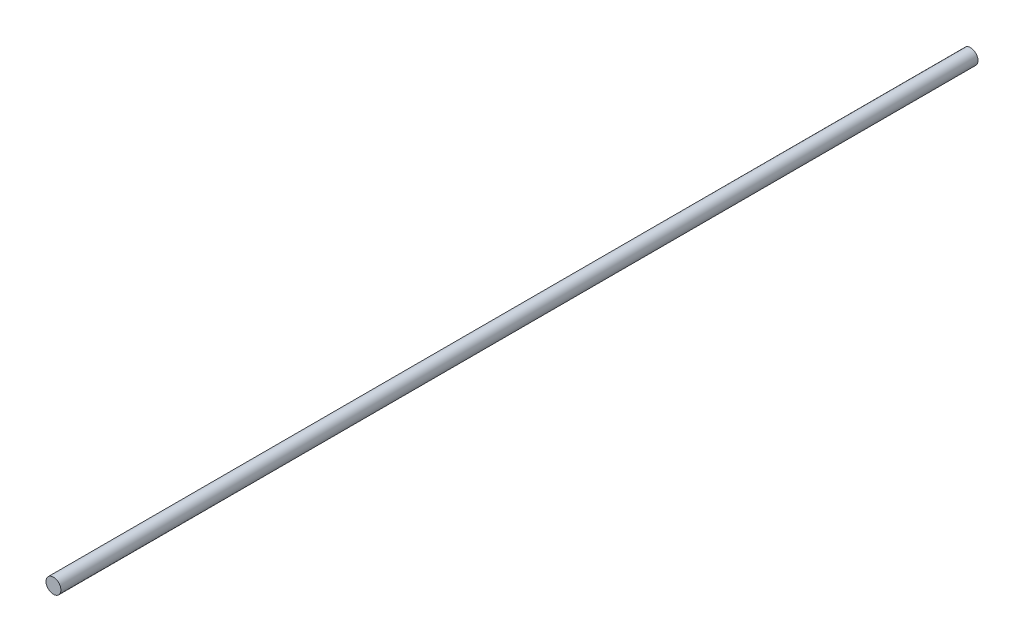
ISO-10303-21;
HEADER;
FILE_DESCRIPTION(('STEP AP214'),'2;1');
FILE_NAME('part.step','',(''),(''),'','','');
FILE_SCHEMA(('AUTOMOTIVE_DESIGN { 1 0 10303 214 1 1 1 1 }'));
ENDSEC;
DATA;
#1=APPLICATION_CONTEXT('core data for automotive mechanical design processes');
#2=APPLICATION_PROTOCOL_DEFINITION('international standard','automotive_design',2000,#1);
#3=PRODUCT_CONTEXT('',#1,'mechanical');
#4=PRODUCT('Part','Part','',(#3));
#5=PRODUCT_RELATED_PRODUCT_CATEGORY('part','',(#4));
#6=PRODUCT_DEFINITION_FORMATION('','',#4);
#7=PRODUCT_DEFINITION_CONTEXT('part definition',#1,'design');
#8=PRODUCT_DEFINITION('design','',#6,#7);
#9=PRODUCT_DEFINITION_SHAPE('','',#8);
#10=(LENGTH_UNIT() NAMED_UNIT(*) SI_UNIT(.MILLI.,.METRE.));
#11=(NAMED_UNIT(*) PLANE_ANGLE_UNIT() SI_UNIT($,.RADIAN.));
#12=(NAMED_UNIT(*) SI_UNIT($,.STERADIAN.) SOLID_ANGLE_UNIT());
#13=UNCERTAINTY_MEASURE_WITH_UNIT(LENGTH_MEASURE(1.E-05),#10,'distance_accuracy_value','');
#14=(GEOMETRIC_REPRESENTATION_CONTEXT(3) GLOBAL_UNCERTAINTY_ASSIGNED_CONTEXT((#13)) GLOBAL_UNIT_ASSIGNED_CONTEXT((#10,
#11,#12)) REPRESENTATION_CONTEXT('',''));
#15=CARTESIAN_POINT('',(0.,0.,0.));
#16=DIRECTION('',(0.,0.,1.));
#17=DIRECTION('',(1.,0.,0.));
#18=AXIS2_PLACEMENT_3D('',#15,#16,#17);
#19=CARTESIAN_POINT('',(0.,0.,615.));
#20=DIRECTION('',(0.,0.,-1.));
#21=DIRECTION('',(-1.,0.,0.));
#22=AXIS2_PLACEMENT_3D('',#19,#20,#21);
#23=CYLINDRICAL_SURFACE('',#22,5.);
#24=CARTESIAN_POINT('',(0.,0.,615.));
#25=DIRECTION('',(0.,0.,1.));
#26=DIRECTION('',(1.,0.,0.));
#27=AXIS2_PLACEMENT_3D('',#24,#25,#26);
#28=CIRCLE('',#27,5.);
#29=CARTESIAN_POINT('',(5.,0.,615.));
#30=VERTEX_POINT('',#29);
#31=EDGE_CURVE('E10',#30,#30,#28,.T.);
#32=ORIENTED_EDGE('',*,*,#31,.F.);
#33=EDGE_LOOP('',(#32));
#34=FACE_BOUND('',#33,.T.);
#35=CARTESIAN_POINT('',(0.,0.,0.));
#36=DIRECTION('',(0.,0.,1.));
#37=DIRECTION('',(1.,0.,0.));
#38=AXIS2_PLACEMENT_3D('',#35,#36,#37);
#39=CIRCLE('',#38,5.);
#40=CARTESIAN_POINT('',(5.,0.,0.));
#41=VERTEX_POINT('',#40);
#42=EDGE_CURVE('E34',#41,#41,#39,.T.);
#43=ORIENTED_EDGE('',*,*,#42,.T.);
#44=EDGE_LOOP('',(#43));
#45=FACE_BOUND('',#44,.T.);
#46=ADVANCED_FACE('F31',(#34,#45),#23,.T.);
#47=CARTESIAN_POINT('',(0.,0.,615.));
#48=DIRECTION('',(0.,0.,1.));
#49=DIRECTION('',(1.,0.,0.));
#50=AXIS2_PLACEMENT_3D('',#47,#48,#49);
#51=PLANE('',#50);
#52=ORIENTED_EDGE('',*,*,#31,.T.);
#53=EDGE_LOOP('',(#52));
#54=FACE_BOUND('',#53,.T.);
#55=ADVANCED_FACE('F46',(#54),#51,.T.);
#56=CARTESIAN_POINT('',(0.,0.,0.));
#57=DIRECTION('',(0.,0.,1.));
#58=DIRECTION('',(1.,0.,0.));
#59=AXIS2_PLACEMENT_3D('',#56,#57,#58);
#60=PLANE('',#59);
#61=ORIENTED_EDGE('',*,*,#42,.F.);
#62=EDGE_LOOP('',(#61));
#63=FACE_BOUND('',#62,.T.);
#64=ADVANCED_FACE('F44',(#63),#60,.F.);
#65=CLOSED_SHELL('',(#46,#55,#64));
#66=MANIFOLD_SOLID_BREP('B2',#65);
#67=ADVANCED_BREP_SHAPE_REPRESENTATION('',(#18,#66),#14);
#68=SHAPE_DEFINITION_REPRESENTATION(#9,#67);
ENDSEC;
END-ISO-10303-21;
